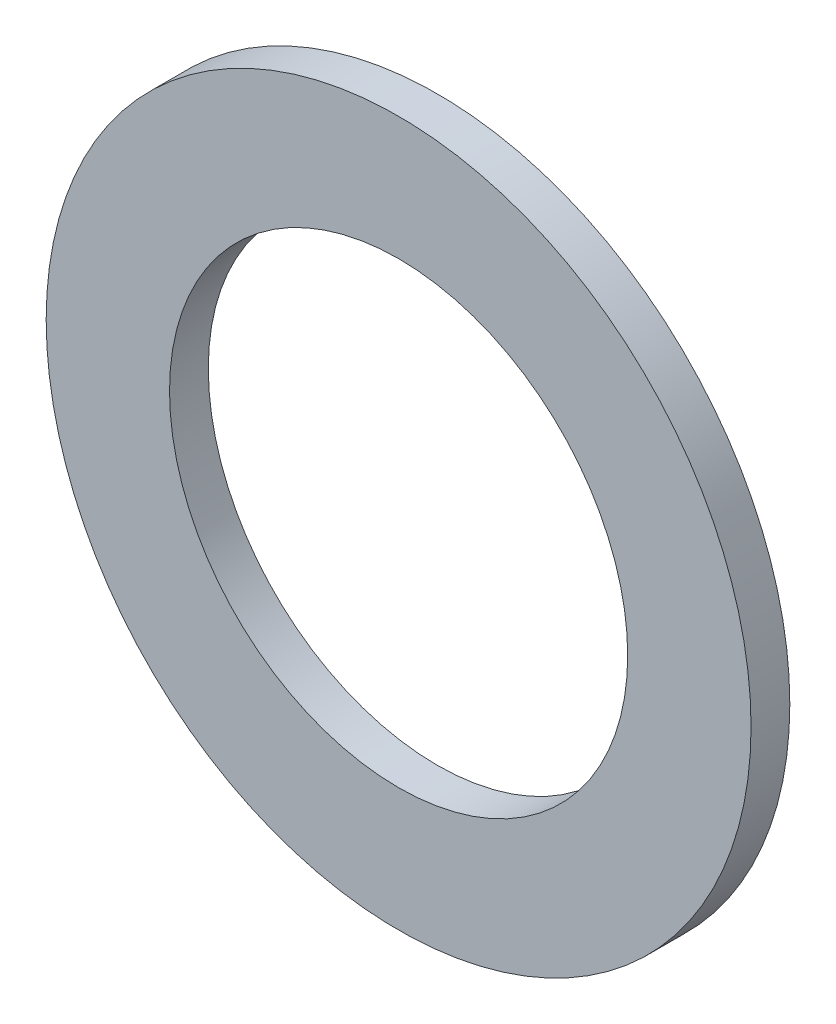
ISO-10303-21;
HEADER;
FILE_DESCRIPTION(('STEP AP214'),'2;1');
FILE_NAME('part.step','',(''),(''),'','','');
FILE_SCHEMA(('AUTOMOTIVE_DESIGN { 1 0 10303 214 1 1 1 1 }'));
ENDSEC;
DATA;
#1=APPLICATION_CONTEXT('core data for automotive mechanical design processes');
#2=APPLICATION_PROTOCOL_DEFINITION('international standard','automotive_design',2000,#1);
#3=PRODUCT_CONTEXT('',#1,'mechanical');
#4=PRODUCT('Part','Part','',(#3));
#5=PRODUCT_RELATED_PRODUCT_CATEGORY('part','',(#4));
#6=PRODUCT_DEFINITION_FORMATION('','',#4);
#7=PRODUCT_DEFINITION_CONTEXT('part definition',#1,'design');
#8=PRODUCT_DEFINITION('design','',#6,#7);
#9=PRODUCT_DEFINITION_SHAPE('','',#8);
#10=(LENGTH_UNIT() NAMED_UNIT(*) SI_UNIT(.MILLI.,.METRE.));
#11=(NAMED_UNIT(*) PLANE_ANGLE_UNIT() SI_UNIT($,.RADIAN.));
#12=(NAMED_UNIT(*) SI_UNIT($,.STERADIAN.) SOLID_ANGLE_UNIT());
#13=UNCERTAINTY_MEASURE_WITH_UNIT(LENGTH_MEASURE(1.E-05),#10,'distance_accuracy_value','');
#14=(GEOMETRIC_REPRESENTATION_CONTEXT(3) GLOBAL_UNCERTAINTY_ASSIGNED_CONTEXT((#13)) GLOBAL_UNIT_ASSIGNED_CONTEXT((#10,
#11,#12)) REPRESENTATION_CONTEXT('',''));
#15=CARTESIAN_POINT('',(0.,0.,0.));
#16=DIRECTION('',(0.,0.,1.));
#17=DIRECTION('',(1.,0.,0.));
#18=AXIS2_PLACEMENT_3D('',#15,#16,#17);
#19=CARTESIAN_POINT('',(0.,0.,1.1));
#20=DIRECTION('',(0.,0.,1.));
#21=DIRECTION('',(1.,0.,0.));
#22=AXIS2_PLACEMENT_3D('',#19,#20,#21);
#23=PLANE('',#22);
#24=CARTESIAN_POINT('',(0.,0.,1.1));
#25=DIRECTION('',(0.,0.,1.));
#26=DIRECTION('',(1.,0.,0.));
#27=AXIS2_PLACEMENT_3D('',#24,#25,#26);
#28=CIRCLE('',#27,10.);
#29=CARTESIAN_POINT('',(10.,0.,1.1));
#30=VERTEX_POINT('',#29);
#31=EDGE_CURVE('E10',#30,#30,#28,.T.);
#32=ORIENTED_EDGE('',*,*,#31,.T.);
#33=EDGE_LOOP('',(#32));
#34=FACE_BOUND('',#33,.T.);
#35=CARTESIAN_POINT('',(0.,0.,1.1));
#36=DIRECTION('',(0.,0.,1.));
#37=DIRECTION('',(1.,0.,0.));
#38=AXIS2_PLACEMENT_3D('',#35,#36,#37);
#39=CIRCLE('',#38,6.5);
#40=CARTESIAN_POINT('',(6.5,0.,1.1));
#41=VERTEX_POINT('',#40);
#42=EDGE_CURVE('E38',#41,#41,#39,.T.);
#43=ORIENTED_EDGE('',*,*,#42,.F.);
#44=EDGE_LOOP('',(#43));
#45=FACE_BOUND('',#44,.T.);
#46=ADVANCED_FACE('F27',(#34,#45),#23,.T.);
#47=CARTESIAN_POINT('',(0.,0.,0.));
#48=DIRECTION('',(0.,0.,1.));
#49=DIRECTION('',(1.,0.,0.));
#50=AXIS2_PLACEMENT_3D('',#47,#48,#49);
#51=PLANE('',#50);
#52=CARTESIAN_POINT('',(0.,0.,0.));
#53=DIRECTION('',(0.,0.,1.));
#54=DIRECTION('',(1.,0.,0.));
#55=AXIS2_PLACEMENT_3D('',#52,#53,#54);
#56=CIRCLE('',#55,10.);
#57=CARTESIAN_POINT('',(10.,0.,0.));
#58=VERTEX_POINT('',#57);
#59=EDGE_CURVE('E34',#58,#58,#56,.T.);
#60=ORIENTED_EDGE('',*,*,#59,.F.);
#61=EDGE_LOOP('',(#60));
#62=FACE_BOUND('',#61,.T.);
#63=CARTESIAN_POINT('',(0.,0.,0.));
#64=DIRECTION('',(0.,0.,1.));
#65=DIRECTION('',(1.,0.,0.));
#66=AXIS2_PLACEMENT_3D('',#63,#64,#65);
#67=CIRCLE('',#66,6.5);
#68=CARTESIAN_POINT('',(6.5,0.,0.));
#69=VERTEX_POINT('',#68);
#70=EDGE_CURVE('E42',#69,#69,#67,.T.);
#71=ORIENTED_EDGE('',*,*,#70,.T.);
#72=EDGE_LOOP('',(#71));
#73=FACE_BOUND('',#72,.T.);
#74=ADVANCED_FACE('F48',(#62,#73),#51,.F.);
#75=CARTESIAN_POINT('',(0.,0.,1.1));
#76=DIRECTION('',(0.,0.,-1.));
#77=DIRECTION('',(-1.,0.,0.));
#78=AXIS2_PLACEMENT_3D('',#75,#76,#77);
#79=CYLINDRICAL_SURFACE('',#78,10.);
#80=ORIENTED_EDGE('',*,*,#31,.F.);
#81=EDGE_LOOP('',(#80));
#82=FACE_BOUND('',#81,.T.);
#83=ORIENTED_EDGE('',*,*,#59,.T.);
#84=EDGE_LOOP('',(#83));
#85=FACE_BOUND('',#84,.T.);
#86=ADVANCED_FACE('F29',(#82,#85),#79,.T.);
#87=CARTESIAN_POINT('',(0.,0.,1.1));
#88=DIRECTION('',(0.,0.,-1.));
#89=DIRECTION('',(-1.,0.,0.));
#90=AXIS2_PLACEMENT_3D('',#87,#88,#89);
#91=CYLINDRICAL_SURFACE('',#90,6.5);
#92=ORIENTED_EDGE('',*,*,#42,.T.);
#93=EDGE_LOOP('',(#92));
#94=FACE_BOUND('',#93,.T.);
#95=ORIENTED_EDGE('',*,*,#70,.F.);
#96=EDGE_LOOP('',(#95));
#97=FACE_BOUND('',#96,.T.);
#98=ADVANCED_FACE('F50',(#94,#97),#91,.F.);
#99=CLOSED_SHELL('',(#46,#74,#86,#98));
#100=MANIFOLD_SOLID_BREP('B2',#99);
#101=ADVANCED_BREP_SHAPE_REPRESENTATION('',(#18,#100),#14);
#102=SHAPE_DEFINITION_REPRESENTATION(#9,#101);
ENDSEC;
END-ISO-10303-21;
